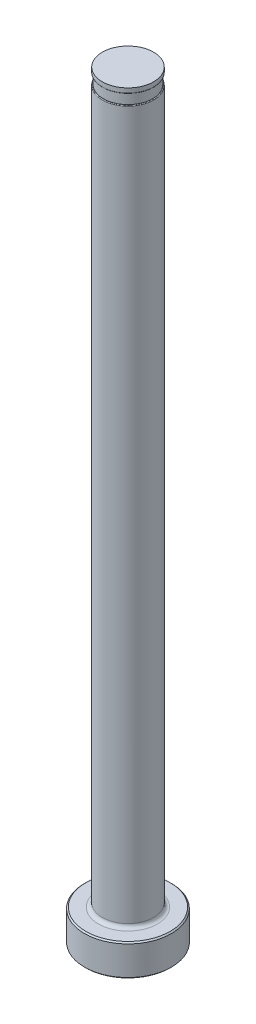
ISO-10303-21;
HEADER;
FILE_DESCRIPTION(('STEP AP214'),'2;1');
FILE_NAME('part.step','',(''),(''),'','','');
FILE_SCHEMA(('AUTOMOTIVE_DESIGN { 1 0 10303 214 1 1 1 1 }'));
ENDSEC;
DATA;
#1=APPLICATION_CONTEXT('core data for automotive mechanical design processes');
#2=APPLICATION_PROTOCOL_DEFINITION('international standard','automotive_design',2000,#1);
#3=PRODUCT_CONTEXT('',#1,'mechanical');
#4=PRODUCT('Part','Part','',(#3));
#5=PRODUCT_RELATED_PRODUCT_CATEGORY('part','',(#4));
#6=PRODUCT_DEFINITION_FORMATION('','',#4);
#7=PRODUCT_DEFINITION_CONTEXT('part definition',#1,'design');
#8=PRODUCT_DEFINITION('design','',#6,#7);
#9=PRODUCT_DEFINITION_SHAPE('','',#8);
#10=(LENGTH_UNIT() NAMED_UNIT(*) SI_UNIT(.MILLI.,.METRE.));
#11=(NAMED_UNIT(*) PLANE_ANGLE_UNIT() SI_UNIT($,.RADIAN.));
#12=(NAMED_UNIT(*) SI_UNIT($,.STERADIAN.) SOLID_ANGLE_UNIT());
#13=UNCERTAINTY_MEASURE_WITH_UNIT(LENGTH_MEASURE(1.E-05),#10,'distance_accuracy_value','');
#14=(GEOMETRIC_REPRESENTATION_CONTEXT(3) GLOBAL_UNCERTAINTY_ASSIGNED_CONTEXT((#13)) GLOBAL_UNIT_ASSIGNED_CONTEXT((#10,
#11,#12)) REPRESENTATION_CONTEXT('',''));
#15=CARTESIAN_POINT('',(0.,0.,0.));
#16=DIRECTION('',(0.,0.,1.));
#17=DIRECTION('',(1.,0.,0.));
#18=AXIS2_PLACEMENT_3D('',#15,#16,#17);
#19=CARTESIAN_POINT('',(-5.15873999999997,151.384,0.));
#20=DIRECTION('',(0.,1.,0.));
#21=DIRECTION('',(0.,0.,1.));
#22=AXIS2_PLACEMENT_3D('',#19,#20,#21);
#23=PLANE('',#22);
#24=CARTESIAN_POINT('',(0.,151.384,0.));
#25=DIRECTION('',(0.,1.,0.));
#26=DIRECTION('',(0.,0.,1.));
#27=AXIS2_PLACEMENT_3D('',#24,#25,#26);
#28=CIRCLE('',#27,5.02665999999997);
#29=CARTESIAN_POINT('',(0.,151.384,5.02665999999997));
#30=VERTEX_POINT('',#29);
#31=EDGE_CURVE('E11',#30,#30,#28,.F.);
#32=ORIENTED_EDGE('',*,*,#31,.T.);
#33=EDGE_LOOP('',(#32));
#34=FACE_BOUND('',#33,.T.);
#35=CARTESIAN_POINT('',(0.,151.384,0.));
#36=DIRECTION('',(0.,1.,0.));
#37=DIRECTION('',(0.,0.,1.));
#38=AXIS2_PLACEMENT_3D('',#35,#36,#37);
#39=CIRCLE('',#38,4.95553999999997);
#40=CARTESIAN_POINT('',(0.,151.384,4.95553999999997));
#41=VERTEX_POINT('',#40);
#42=EDGE_CURVE('E78',#41,#41,#39,.T.);
#43=ORIENTED_EDGE('',*,*,#42,.T.);
#44=EDGE_LOOP('',(#43));
#45=FACE_BOUND('',#44,.T.);
#46=ADVANCED_FACE('F36',(#34,#45),#23,.F.);
#47=CARTESIAN_POINT('',(0.,259.958771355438,0.));
#48=DIRECTION('',(0.,1.,0.));
#49=DIRECTION('',(0.,0.,1.));
#50=AXIS2_PLACEMENT_3D('',#47,#48,#49);
#51=CYLINDRICAL_SURFACE('',#50,5.15873999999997);
#52=DIRECTION('',(0.,1.,0.));
#53=VECTOR('',#52,1.);
#54=CARTESIAN_POINT('',(-4.95553999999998,259.958771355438,-1.43360444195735));
#55=LINE('',#54,#53);
#56=CARTESIAN_POINT('',(-4.95553999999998,149.225,-1.43360444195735));
#57=VERTEX_POINT('',#56);
#58=CARTESIAN_POINT('',(-4.95553999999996,86.868,-1.43360444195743));
#59=VERTEX_POINT('',#58);
#60=EDGE_CURVE('E73',#57,#59,#55,.F.);
#61=ORIENTED_EDGE('',*,*,#60,.F.);
#62=CARTESIAN_POINT('',(0.,149.225,0.));
#63=DIRECTION('',(0.,-1.,0.));
#64=DIRECTION('',(0.,0.,-1.));
#65=AXIS2_PLACEMENT_3D('',#62,#63,#64);
#66=CIRCLE('',#65,5.15873999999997);
#67=CARTESIAN_POINT('',(-4.95553999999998,149.225,1.43360444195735));
#68=VERTEX_POINT('',#67);
#69=EDGE_CURVE('E51',#57,#68,#66,.T.);
#70=ORIENTED_EDGE('',*,*,#69,.T.);
#71=DIRECTION('',(0.,1.,0.));
#72=VECTOR('',#71,1.);
#73=CARTESIAN_POINT('',(-4.95553999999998,259.958771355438,1.43360444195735));
#74=LINE('',#73,#72);
#75=CARTESIAN_POINT('',(-4.95553999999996,86.868,1.43360444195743));
#76=VERTEX_POINT('',#75);
#77=EDGE_CURVE('E84',#76,#68,#74,.T.);
#78=ORIENTED_EDGE('',*,*,#77,.F.);
#79=CARTESIAN_POINT('',(-4.95553999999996,86.868,-1.43360444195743));
#80=CARTESIAN_POINT('',(-4.95553725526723,86.8396189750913,-1.43360739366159));
#81=CARTESIAN_POINT('',(-4.95592104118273,86.8112557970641,-1.43228786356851));
#82=CARTESIAN_POINT('',(-4.95743326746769,86.7548072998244,-1.42704770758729));
#83=CARTESIAN_POINT('',(-4.9585612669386,86.7267218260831,-1.42312862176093));
#84=CARTESIAN_POINT('',(-4.9629961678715,86.6436356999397,-1.40761778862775));
#85=CARTESIAN_POINT('',(-4.96735491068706,86.5893485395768,-1.39227082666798));
#86=CARTESIAN_POINT('',(-4.97832723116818,86.4846470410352,-1.3525060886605));
#87=CARTESIAN_POINT('',(-4.98493672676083,86.43422589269,-1.32810472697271));
#88=CARTESIAN_POINT('',(-4.99967949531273,86.3381857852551,-1.27147840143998));
#89=CARTESIAN_POINT('',(-5.00781478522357,86.292573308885,-1.23924306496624));
#90=CARTESIAN_POINT('',(-5.02495905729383,86.2062108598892,-1.16779718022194));
#91=CARTESIAN_POINT('',(-5.03397951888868,86.1655461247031,-1.12848730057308));
#92=CARTESIAN_POINT('',(-5.05205730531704,86.0901357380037,-1.04458765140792));
#93=CARTESIAN_POINT('',(-5.06111464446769,86.0553926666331,-0.999995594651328));
#94=CARTESIAN_POINT('',(-5.0828087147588,85.976744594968,-0.884599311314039));
#95=CARTESIAN_POINT('',(-5.09511168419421,85.9362810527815,-0.811374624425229));
#96=CARTESIAN_POINT('',(-5.11705340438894,85.8675884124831,-0.659025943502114));
#97=CARTESIAN_POINT('',(-5.12668809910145,85.8393779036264,-0.579893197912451));
#98=CARTESIAN_POINT('',(-5.14250736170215,85.7942853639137,-0.417111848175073));
#99=CARTESIAN_POINT('',(-5.14864831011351,85.7775460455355,-0.333419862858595));
#100=CARTESIAN_POINT('',(-5.15681634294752,85.7554682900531,-0.164367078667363));
#101=CARTESIAN_POINT('',(-5.15884262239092,85.7501320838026,-0.0790059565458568));
#102=CARTESIAN_POINT('',(-5.15861184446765,85.7507349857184,0.105901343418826));
#103=CARTESIAN_POINT('',(-5.15558674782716,85.7586959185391,0.205446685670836));
#104=CARTESIAN_POINT('',(-5.14401053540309,85.7902458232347,0.401751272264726));
#105=CARTESIAN_POINT('',(-5.13546035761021,85.8138321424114,0.49851098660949));
#106=CARTESIAN_POINT('',(-5.11591338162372,85.8713193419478,0.667702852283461));
#107=CARTESIAN_POINT('',(-5.10571393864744,85.9023284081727,0.741210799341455));
#108=CARTESIAN_POINT('',(-5.08327564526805,85.975657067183,0.882022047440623));
#109=CARTESIAN_POINT('',(-5.07103965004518,86.017960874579,0.949333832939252));
#110=CARTESIAN_POINT('',(-5.04847334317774,86.1044217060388,1.06213618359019));
#111=CARTESIAN_POINT('',(-5.03826194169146,86.146449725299,1.10927984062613));
#112=CARTESIAN_POINT('',(-5.01836605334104,86.2377827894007,1.19606762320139));
#113=CARTESIAN_POINT('',(-5.00868105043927,86.2870805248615,1.23571919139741));
#114=CARTESIAN_POINT('',(-4.99227488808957,86.3843011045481,1.30028176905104));
#115=CARTESIAN_POINT('',(-4.98532701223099,86.4313061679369,1.3265147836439));
#116=CARTESIAN_POINT('',(-4.97328889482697,86.5291640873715,1.37095861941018));
#117=CARTESIAN_POINT('',(-4.96819584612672,86.5800109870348,1.38918157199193));
#118=CARTESIAN_POINT('',(-4.96145831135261,86.6704594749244,1.41302693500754));
#119=CARTESIAN_POINT('',(-4.95925840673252,86.7094867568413,1.42070567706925));
#120=CARTESIAN_POINT('',(-4.95629015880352,86.7883307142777,1.43101136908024));
#121=CARTESIAN_POINT('',(-4.95552461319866,86.8281487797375,1.43362844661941));
#122=CARTESIAN_POINT('',(-4.95553999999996,86.868,1.43360444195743));
#123=B_SPLINE_CURVE_WITH_KNOTS('',3,(#79,#80,#81,#82,#83,#84,#85,#86,#87,#88,#89,#90,#91,#92,
#93,#94,#95,#96,#97,#98,#99,#100,#101,#102,#103,#104,#105,#106,#107,#108,#109,#110,#111,#112,
#113,#114,#115,#116,#117,#118,#119,#120,#121,#122),.UNSPECIFIED.,.F.,.F.,(4,2,2,2,2,2,2,2,2,2,2,
2,2,2,2,2,2,2,2,2,2,4),(0.,0.0850755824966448,0.170100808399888,0.338803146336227,
0.507201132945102,0.675823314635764,0.847029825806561,1.01831074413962,1.27062211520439,
1.52331494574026,1.77909706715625,2.03492922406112,2.33328986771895,2.63159987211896,
2.87199032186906,3.11204654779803,3.30325159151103,3.49426568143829,3.6564175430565,
3.81832296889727,3.9374932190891,4.05689566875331),.UNSPECIFIED.);
#124=EDGE_CURVE('E81',#59,#76,#123,.T.);
#125=ORIENTED_EDGE('',*,*,#124,.F.);
#126=EDGE_LOOP('',(#61,#70,#78,#125));
#127=FACE_BOUND('',#126,.T.);
#128=CARTESIAN_POINT('',(0.,7.11200000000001,0.));
#129=DIRECTION('',(0.,1.,0.));
#130=DIRECTION('',(0.,0.,1.));
#131=AXIS2_PLACEMENT_3D('',#128,#129,#130);
#132=CIRCLE('',#131,5.15873999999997);
#133=CARTESIAN_POINT('',(0.,7.11200000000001,5.15873999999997));
#134=VERTEX_POINT('',#133);
#135=EDGE_CURVE('E116',#134,#134,#132,.T.);
#136=ORIENTED_EDGE('',*,*,#135,.T.);
#137=EDGE_LOOP('',(#136));
#138=FACE_BOUND('',#137,.T.);
#139=ADVANCED_FACE('F82',(#127,#138),#51,.T.);
#140=CARTESIAN_POINT('',(0.,0.,0.));
#141=DIRECTION('',(0.,-1.,0.));
#142=DIRECTION('',(0.,0.,-1.));
#143=AXIS2_PLACEMENT_3D('',#140,#141,#142);
#144=PLANE('',#143);
#145=CARTESIAN_POINT('',(0.,0.,0.));
#146=DIRECTION('',(0.,-1.,0.));
#147=DIRECTION('',(0.,0.,-1.));
#148=AXIS2_PLACEMENT_3D('',#145,#146,#147);
#149=CIRCLE('',#148,8.47089999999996);
#150=CARTESIAN_POINT('',(0.,0.,-8.47089999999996));
#151=VERTEX_POINT('',#150);
#152=EDGE_CURVE('E113',#151,#151,#149,.T.);
#153=ORIENTED_EDGE('',*,*,#152,.T.);
#154=EDGE_LOOP('',(#153));
#155=FACE_BOUND('',#154,.T.);
#156=ADVANCED_FACE('F192',(#155),#144,.T.);
#157=CARTESIAN_POINT('',(0.,259.958771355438,0.));
#158=DIRECTION('',(0.,1.,0.));
#159=DIRECTION('',(0.,0.,1.));
#160=AXIS2_PLACEMENT_3D('',#157,#158,#159);
#161=CYLINDRICAL_SURFACE('',#160,8.72489999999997);
#162=CARTESIAN_POINT('',(0.,6.09600000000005,0.));
#163=DIRECTION('',(0.,1.,0.));
#164=DIRECTION('',(0.,0.,1.));
#165=AXIS2_PLACEMENT_3D('',#162,#163,#164);
#166=CIRCLE('',#165,8.72489999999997);
#167=CARTESIAN_POINT('',(0.,6.09600000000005,8.72489999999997));
#168=VERTEX_POINT('',#167);
#169=EDGE_CURVE('E110',#168,#168,#166,.F.);
#170=ORIENTED_EDGE('',*,*,#169,.T.);
#171=EDGE_LOOP('',(#170));
#172=FACE_BOUND('',#171,.T.);
#173=CARTESIAN_POINT('',(0.,0.254000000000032,0.));
#174=DIRECTION('',(0.,-1.,0.));
#175=DIRECTION('',(0.,0.,-1.));
#176=AXIS2_PLACEMENT_3D('',#173,#174,#175);
#177=CIRCLE('',#176,8.72489999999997);
#178=CARTESIAN_POINT('',(0.,0.254000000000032,-8.72489999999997));
#179=VERTEX_POINT('',#178);
#180=EDGE_CURVE('E107',#179,#179,#177,.F.);
#181=ORIENTED_EDGE('',*,*,#180,.T.);
#182=EDGE_LOOP('',(#181));
#183=FACE_BOUND('',#182,.T.);
#184=ADVANCED_FACE('F195',(#172,#183),#161,.T.);
#185=CARTESIAN_POINT('',(-8.72489999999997,6.35,0.));
#186=DIRECTION('',(0.,1.,0.));
#187=DIRECTION('',(0.,0.,1.));
#188=AXIS2_PLACEMENT_3D('',#185,#186,#187);
#189=PLANE('',#188);
#190=CARTESIAN_POINT('',(0.,6.35,0.));
#191=DIRECTION('',(0.,1.,0.));
#192=DIRECTION('',(0.,0.,1.));
#193=AXIS2_PLACEMENT_3D('',#190,#191,#192);
#194=CIRCLE('',#193,5.92073999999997);
#195=CARTESIAN_POINT('',(0.,6.35,5.92073999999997));
#196=VERTEX_POINT('',#195);
#197=EDGE_CURVE('E87',#196,#196,#194,.F.);
#198=ORIENTED_EDGE('',*,*,#197,.T.);
#199=EDGE_LOOP('',(#198));
#200=FACE_BOUND('',#199,.T.);
#201=CARTESIAN_POINT('',(0.,6.35,0.));
#202=DIRECTION('',(0.,1.,0.));
#203=DIRECTION('',(0.,0.,1.));
#204=AXIS2_PLACEMENT_3D('',#201,#202,#203);
#205=CIRCLE('',#204,8.47090000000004);
#206=CARTESIAN_POINT('',(0.,6.35,8.47090000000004));
#207=VERTEX_POINT('',#206);
#208=EDGE_CURVE('E104',#207,#207,#205,.T.);
#209=ORIENTED_EDGE('',*,*,#208,.T.);
#210=EDGE_LOOP('',(#209));
#211=FACE_BOUND('',#210,.T.);
#212=ADVANCED_FACE('F190',(#200,#211),#189,.T.);
#213=CARTESIAN_POINT('',(0.,6.35000000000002,0.));
#214=DIRECTION('',(0.,-1.,0.));
#215=DIRECTION('',(0.,0.,-1.));
#216=AXIS2_PLACEMENT_3D('',#213,#214,#215);
#217=CONICAL_SURFACE('',#216,8.47090000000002,0.785398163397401);
#218=ORIENTED_EDGE('',*,*,#169,.F.);
#219=EDGE_LOOP('',(#218));
#220=FACE_BOUND('',#219,.T.);
#221=ORIENTED_EDGE('',*,*,#208,.F.);
#222=EDGE_LOOP('',(#221));
#223=FACE_BOUND('',#222,.T.);
#224=ADVANCED_FACE('F186',(#220,#223),#217,.T.);
#225=CARTESIAN_POINT('',(0.,0.254000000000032,0.));
#226=DIRECTION('',(0.,1.,0.));
#227=DIRECTION('',(0.,0.,1.));
#228=AXIS2_PLACEMENT_3D('',#225,#226,#227);
#229=CONICAL_SURFACE('',#228,8.72489999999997,0.785398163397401);
#230=ORIENTED_EDGE('',*,*,#152,.F.);
#231=EDGE_LOOP('',(#230));
#232=FACE_BOUND('',#231,.T.);
#233=ORIENTED_EDGE('',*,*,#180,.F.);
#234=EDGE_LOOP('',(#233));
#235=FACE_BOUND('',#234,.T.);
#236=ADVANCED_FACE('F182',(#232,#235),#229,.T.);
#237=CARTESIAN_POINT('',(0.,7.11200000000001,0.));
#238=DIRECTION('',(0.,1.,0.));
#239=DIRECTION('',(0.,0.,1.));
#240=AXIS2_PLACEMENT_3D('',#237,#238,#239);
#241=TOROIDAL_SURFACE('',#240,5.92073999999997,0.762);
#242=ORIENTED_EDGE('',*,*,#197,.F.);
#243=EDGE_LOOP('',(#242));
#244=FACE_BOUND('',#243,.T.);
#245=ORIENTED_EDGE('',*,*,#135,.F.);
#246=EDGE_LOOP('',(#245));
#247=FACE_BOUND('',#246,.T.);
#248=ADVANCED_FACE('F147',(#244,#247),#241,.F.);
#249=CARTESIAN_POINT('',(-5.15873999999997,149.352,0.));
#250=DIRECTION('',(0.,-1.,0.));
#251=DIRECTION('',(0.,0.,-1.));
#252=AXIS2_PLACEMENT_3D('',#249,#250,#251);
#253=PLANE('',#252);
#254=DIRECTION('',(0.,0.,1.));
#255=VECTOR('',#254,1.);
#256=CARTESIAN_POINT('',(-4.95553999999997,149.352,0.));
#257=LINE('',#256,#255);
#258=CARTESIAN_POINT('',(-4.95553999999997,149.352,0.));
#259=VERTEX_POINT('',#258);
#260=CARTESIAN_POINT('',(-4.95553999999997,149.352,0.872370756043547));
#261=VERTEX_POINT('',#260);
#262=EDGE_CURVE('E90',#259,#261,#257,.T.);
#263=ORIENTED_EDGE('',*,*,#262,.T.);
#264=CARTESIAN_POINT('',(0.,149.352,0.));
#265=DIRECTION('',(0.,-1.,0.));
#266=DIRECTION('',(0.,0.,-1.));
#267=AXIS2_PLACEMENT_3D('',#264,#265,#266);
#268=CIRCLE('',#267,5.03173999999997);
#269=CARTESIAN_POINT('',(-4.95553999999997,149.352,-0.872370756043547));
#270=VERTEX_POINT('',#269);
#271=EDGE_CURVE('E86',#261,#270,#268,.F.);
#272=ORIENTED_EDGE('',*,*,#271,.T.);
#273=EDGE_CURVE('E79',#270,#259,#257,.T.);
#274=ORIENTED_EDGE('',*,*,#273,.T.);
#275=CARTESIAN_POINT('',(0.,149.352,0.));
#276=DIRECTION('',(0.,1.,0.));
#277=DIRECTION('',(0.,0.,1.));
#278=AXIS2_PLACEMENT_3D('',#275,#276,#277);
#279=CIRCLE('',#278,4.95553999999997);
#280=EDGE_CURVE('E101',#259,#259,#279,.T.);
#281=ORIENTED_EDGE('',*,*,#280,.F.);
#282=EDGE_LOOP('',(#263,#272,#274,#281));
#283=FACE_BOUND('',#282,.T.);
#284=ADVANCED_FACE('F144',(#283),#253,.F.);
#285=CARTESIAN_POINT('',(0.,153.448281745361,0.));
#286=DIRECTION('',(0.,1.,0.));
#287=DIRECTION('',(0.,0.,1.));
#288=AXIS2_PLACEMENT_3D('',#285,#286,#287);
#289=CYLINDRICAL_SURFACE('',#288,4.95553999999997);
#290=ORIENTED_EDGE('',*,*,#42,.F.);
#291=EDGE_LOOP('',(#290));
#292=FACE_BOUND('',#291,.T.);
#293=ORIENTED_EDGE('',*,*,#280,.T.);
#294=EDGE_LOOP('',(#293));
#295=FACE_BOUND('',#294,.T.);
#296=ADVANCED_FACE('F141',(#292,#295),#289,.T.);
#297=CARTESIAN_POINT('',(-4.95553999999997,150.368,-8.72489999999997));
#298=DIRECTION('',(1.,0.,0.));
#299=DIRECTION('',(0.,1.,0.));
#300=AXIS2_PLACEMENT_3D('',#297,#298,#299);
#301=PLANE('',#300);
#302=ORIENTED_EDGE('',*,*,#273,.F.);
#303=CARTESIAN_POINT('',(-4.95553999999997,149.352,-0.872370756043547));
#304=CARTESIAN_POINT('',(-4.95553999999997,149.351997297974,-0.893106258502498));
#305=CARTESIAN_POINT('',(-4.95553999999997,149.351847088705,-0.913843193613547));
#306=CARTESIAN_POINT('',(-4.95553999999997,149.351170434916,-0.955336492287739));
#307=CARTESIAN_POINT('',(-4.95553999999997,149.350643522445,-0.976092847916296));
#308=CARTESIAN_POINT('',(-4.95553999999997,149.349099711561,-1.01847199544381));
#309=CARTESIAN_POINT('',(-4.95553999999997,149.34806293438,-1.04009410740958));
#310=CARTESIAN_POINT('',(-4.95553999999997,149.345368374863,-1.08327970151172));
#311=CARTESIAN_POINT('',(-4.95553999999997,149.343711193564,-1.10484322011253));
#312=CARTESIAN_POINT('',(-4.95553999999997,149.339606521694,-1.14789214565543));
#313=CARTESIAN_POINT('',(-4.95553999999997,149.337159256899,-1.16937757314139));
#314=CARTESIAN_POINT('',(-4.95553999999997,149.331206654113,-1.21226394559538));
#315=CARTESIAN_POINT('',(-4.95553999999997,149.327698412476,-1.23366449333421));
#316=CARTESIAN_POINT('',(-4.95553999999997,149.319283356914,-1.2757822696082));
#317=CARTESIAN_POINT('',(-4.95553999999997,149.31440504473,-1.29650469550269));
#318=CARTESIAN_POINT('',(-4.95553999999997,149.305386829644,-1.32704228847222));
#319=CARTESIAN_POINT('',(-4.95553999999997,149.302106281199,-1.33710914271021));
#320=CARTESIAN_POINT('',(-4.95553999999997,149.29476790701,-1.35695139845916));
#321=CARTESIAN_POINT('',(-4.95553999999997,149.290711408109,-1.36672726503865));
#322=CARTESIAN_POINT('',(-4.95553999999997,149.283963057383,-1.38055335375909));
#323=CARTESIAN_POINT('',(-4.95553999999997,149.281728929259,-1.38482589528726));
#324=CARTESIAN_POINT('',(-4.95553999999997,149.276950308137,-1.39320953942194));
#325=CARTESIAN_POINT('',(-4.95553999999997,149.274405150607,-1.39732027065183));
#326=CARTESIAN_POINT('',(-4.95553999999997,149.268903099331,-1.40530983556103));
#327=CARTESIAN_POINT('',(-4.95553999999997,149.265943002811,-1.4091864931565));
#328=CARTESIAN_POINT('',(-4.95553999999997,149.259504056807,-1.4164922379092));
#329=CARTESIAN_POINT('',(-4.95553999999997,149.256026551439,-1.41992244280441));
#330=CARTESIAN_POINT('',(-4.95553999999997,149.250255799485,-1.4245087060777));
#331=CARTESIAN_POINT('',(-4.95553999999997,149.248201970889,-1.42596287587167));
#332=CARTESIAN_POINT('',(-4.95553999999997,149.243918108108,-1.42856560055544));
#333=CARTESIAN_POINT('',(-4.95553999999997,149.24168896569,-1.42971558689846));
#334=CARTESIAN_POINT('',(-4.95553999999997,149.237116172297,-1.4315912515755));
#335=CARTESIAN_POINT('',(-4.95553999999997,149.234776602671,-1.43232653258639));
#336=CARTESIAN_POINT('',(-4.95553999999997,149.229963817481,-1.43334161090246));
#337=CARTESIAN_POINT('',(-4.95553999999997,149.227489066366,-1.43361396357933));
#338=CARTESIAN_POINT('',(-4.95553999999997,149.225,-1.4336044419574));
#339=B_SPLINE_CURVE_WITH_KNOTS('',3,(#303,#304,#305,#306,#307,#308,#309,#310,#311,#312,#313,
#314,#315,#316,#317,#318,#319,#320,#321,#322,#323,#324,#325,#326,#327,#328,#329,#330,#331,#332,
#333,#334,#335,#336,#337,#338),.UNSPECIFIED.,.F.,.F.,(4,2,2,2,2,2,2,2,2,2,2,2,2,2,2,2,2,4),(0.,
0.0622081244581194,0.124493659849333,0.189427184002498,0.254297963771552,0.319150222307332,
0.384181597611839,0.447949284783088,0.47969514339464,0.51138719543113,0.525842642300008,
0.540329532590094,0.554935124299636,0.569503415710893,0.577034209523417,0.584528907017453,
0.591842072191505,0.59927176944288),.UNSPECIFIED.);
#340=EDGE_CURVE('E59',#270,#57,#339,.T.);
#341=ORIENTED_EDGE('',*,*,#340,.T.);
#342=ORIENTED_EDGE('',*,*,#60,.T.);
#343=DIRECTION('',(0.,0.,1.));
#344=VECTOR('',#343,1.);
#345=CARTESIAN_POINT('',(-4.95553999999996,86.868,-8.72489999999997));
#346=LINE('',#345,#344);
#347=EDGE_CURVE('E77',#59,#76,#346,.T.);
#348=ORIENTED_EDGE('',*,*,#347,.T.);
#349=ORIENTED_EDGE('',*,*,#77,.T.);
#350=CARTESIAN_POINT('',(-4.95553999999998,149.225,1.43360444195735));
#351=CARTESIAN_POINT('',(-4.95553999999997,149.227376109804,1.43361259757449));
#352=CARTESIAN_POINT('',(-4.95553999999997,149.229740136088,1.4333648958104));
#353=CARTESIAN_POINT('',(-4.95553999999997,149.234346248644,1.43243706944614));
#354=CARTESIAN_POINT('',(-4.95553999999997,149.236589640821,1.43176356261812));
#355=CARTESIAN_POINT('',(-4.95553999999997,149.241448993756,1.4298565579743));
#356=CARTESIAN_POINT('',(-4.95553999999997,149.244026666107,1.42852797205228));
#357=CARTESIAN_POINT('',(-4.95553999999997,149.248948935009,1.42547523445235));
#358=CARTESIAN_POINT('',(-4.95553999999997,149.251291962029,1.42374864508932));
#359=CARTESIAN_POINT('',(-4.95553999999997,149.257411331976,1.4186377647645));
#360=CARTESIAN_POINT('',(-4.95553999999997,149.260953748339,1.41497736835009));
#361=CARTESIAN_POINT('',(-4.95553999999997,149.267498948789,1.40721445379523));
#362=CARTESIAN_POINT('',(-4.95553999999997,149.270500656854,1.40311107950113));
#363=CARTESIAN_POINT('',(-4.95553999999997,149.277478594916,1.39255193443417));
#364=CARTESIAN_POINT('',(-4.95553999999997,149.281205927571,1.38593356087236));
#365=CARTESIAN_POINT('',(-4.95553999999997,149.288038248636,1.37237820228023));
#366=CARTESIAN_POINT('',(-4.95553999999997,149.291141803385,1.36544052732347));
#367=CARTESIAN_POINT('',(-4.95553999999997,149.299787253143,1.34428318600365));
#368=CARTESIAN_POINT('',(-4.95553999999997,149.304628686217,1.32978099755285));
#369=CARTESIAN_POINT('',(-4.95553999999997,149.317034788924,1.28723764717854));
#370=CARTESIAN_POINT('',(-4.95553999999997,149.323113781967,1.25878972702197));
#371=CARTESIAN_POINT('',(-4.95553999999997,149.333029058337,1.20147182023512));
#372=CARTESIAN_POINT('',(-4.95553999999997,149.336859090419,1.17260088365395));
#373=CARTESIAN_POINT('',(-4.95553999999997,149.342985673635,1.1146900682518));
#374=CARTESIAN_POINT('',(-4.95553999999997,149.345281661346,1.08565013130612));
#375=CARTESIAN_POINT('',(-4.95553999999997,149.348773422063,1.02754153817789));
#376=CARTESIAN_POINT('',(-4.95553999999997,149.349970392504,0.998472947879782));
#377=CARTESIAN_POINT('',(-4.95553999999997,149.35119494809,0.953200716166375));
#378=CARTESIAN_POINT('',(-4.95553999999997,149.351505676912,0.937003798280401));
#379=CARTESIAN_POINT('',(-4.95553999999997,149.351907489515,0.90466142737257));
#380=CARTESIAN_POINT('',(-4.95553999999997,149.351999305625,0.888515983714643));
#381=CARTESIAN_POINT('',(-4.95553999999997,149.352,0.872370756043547));
#382=B_SPLINE_CURVE_WITH_KNOTS('',3,(#350,#351,#352,#353,#354,#355,#356,#357,#358,#359,#360,
#361,#362,#363,#364,#365,#366,#367,#368,#369,#370,#371,#372,#373,#374,#375,#376,#377,#378,#379,
#380,#381),.UNSPECIFIED.,.F.,.F.,(4,2,2,2,2,2,2,2,2,2,2,2,2,2,2,4),(0.,0.00709610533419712,
0.0140845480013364,0.0227350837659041,0.0314400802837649,0.0466358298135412,0.0618614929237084,
0.0845916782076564,0.107373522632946,0.15314866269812,0.240236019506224,0.327564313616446,
0.414924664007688,0.502189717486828,0.550788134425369,0.599223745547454),.UNSPECIFIED.);
#383=EDGE_CURVE('E172',#68,#261,#382,.T.);
#384=ORIENTED_EDGE('',*,*,#383,.T.);
#385=ORIENTED_EDGE('',*,*,#262,.F.);
#386=EDGE_LOOP('',(#302,#341,#342,#348,#349,#384,#385));
#387=FACE_BOUND('',#386,.T.);
#388=ADVANCED_FACE('F75',(#387),#301,.F.);
#389=CARTESIAN_POINT('',(-8.13053999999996,86.868,-8.72489999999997));
#390=DIRECTION('',(0.,0.,1.));
#391=DIRECTION('',(1.,0.,0.));
#392=AXIS2_PLACEMENT_3D('',#389,#390,#391);
#393=CYLINDRICAL_SURFACE('',#392,3.175);
#394=ORIENTED_EDGE('',*,*,#347,.F.);
#395=ORIENTED_EDGE('',*,*,#124,.T.);
#396=EDGE_LOOP('',(#394,#395));
#397=FACE_BOUND('',#396,.T.);
#398=ADVANCED_FACE('F89',(#397),#393,.F.);
#399=CARTESIAN_POINT('',(0.,152.687735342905,0.));
#400=DIRECTION('',(0.,1.,0.));
#401=DIRECTION('',(0.,0.,1.));
#402=AXIS2_PLACEMENT_3D('',#399,#400,#401);
#403=CYLINDRICAL_SURFACE('',#402,5.15365999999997);
#404=CARTESIAN_POINT('',(0.,151.511,0.));
#405=DIRECTION('',(0.,1.,0.));
#406=DIRECTION('',(0.,0.,1.));
#407=AXIS2_PLACEMENT_3D('',#404,#405,#406);
#408=CIRCLE('',#407,5.15365999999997);
#409=CARTESIAN_POINT('',(0.,151.511,5.15365999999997));
#410=VERTEX_POINT('',#409);
#411=EDGE_CURVE('E44',#410,#410,#408,.T.);
#412=ORIENTED_EDGE('',*,*,#411,.T.);
#413=EDGE_LOOP('',(#412));
#414=FACE_BOUND('',#413,.T.);
#415=CARTESIAN_POINT('',(0.,152.4,0.));
#416=DIRECTION('',(0.,1.,0.));
#417=DIRECTION('',(0.,0.,1.));
#418=AXIS2_PLACEMENT_3D('',#415,#416,#417);
#419=CIRCLE('',#418,5.15365999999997);
#420=CARTESIAN_POINT('',(0.,152.4,5.15365999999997));
#421=VERTEX_POINT('',#420);
#422=EDGE_CURVE('E91',#421,#421,#419,.T.);
#423=ORIENTED_EDGE('',*,*,#422,.F.);
#424=EDGE_LOOP('',(#423));
#425=FACE_BOUND('',#424,.T.);
#426=ADVANCED_FACE('F135',(#414,#425),#403,.T.);
#427=CARTESIAN_POINT('',(-5.15873999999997,152.4,0.));
#428=DIRECTION('',(0.,1.,0.));
#429=DIRECTION('',(0.,0.,1.));
#430=AXIS2_PLACEMENT_3D('',#427,#428,#429);
#431=PLANE('',#430);
#432=ORIENTED_EDGE('',*,*,#422,.T.);
#433=EDGE_LOOP('',(#432));
#434=FACE_BOUND('',#433,.T.);
#435=ADVANCED_FACE('F149',(#434),#431,.T.);
#436=CARTESIAN_POINT('',(0.,149.225,0.));
#437=DIRECTION('',(0.,-1.,0.));
#438=DIRECTION('',(0.,0.,-1.));
#439=AXIS2_PLACEMENT_3D('',#436,#437,#438);
#440=TOROIDAL_SURFACE('',#439,5.03173999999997,0.127);
#441=ORIENTED_EDGE('',*,*,#383,.F.);
#442=ORIENTED_EDGE('',*,*,#69,.F.);
#443=ORIENTED_EDGE('',*,*,#340,.F.);
#444=ORIENTED_EDGE('',*,*,#271,.F.);
#445=EDGE_LOOP('',(#441,#442,#443,#444));
#446=FACE_BOUND('',#445,.T.);
#447=ADVANCED_FACE('F151',(#446),#440,.T.);
#448=CARTESIAN_POINT('',(0.,151.511,0.));
#449=DIRECTION('',(0.,1.,0.));
#450=DIRECTION('',(0.,0.,1.));
#451=AXIS2_PLACEMENT_3D('',#448,#449,#450);
#452=TOROIDAL_SURFACE('',#451,5.02665999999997,0.127);
#453=ORIENTED_EDGE('',*,*,#31,.F.);
#454=EDGE_LOOP('',(#453));
#455=FACE_BOUND('',#454,.T.);
#456=ORIENTED_EDGE('',*,*,#411,.F.);
#457=EDGE_LOOP('',(#456));
#458=FACE_BOUND('',#457,.T.);
#459=ADVANCED_FACE('F38',(#455,#458),#452,.T.);
#460=CLOSED_SHELL('',(#46,#139,#156,#184,#212,#224,#236,#248,#284,#296,#388,#398,#426,#435,#447,#459));
#461=MANIFOLD_SOLID_BREP('B2',#460);
#462=ADVANCED_BREP_SHAPE_REPRESENTATION('',(#18,#461),#14);
#463=SHAPE_DEFINITION_REPRESENTATION(#9,#462);
ENDSEC;
END-ISO-10303-21;
